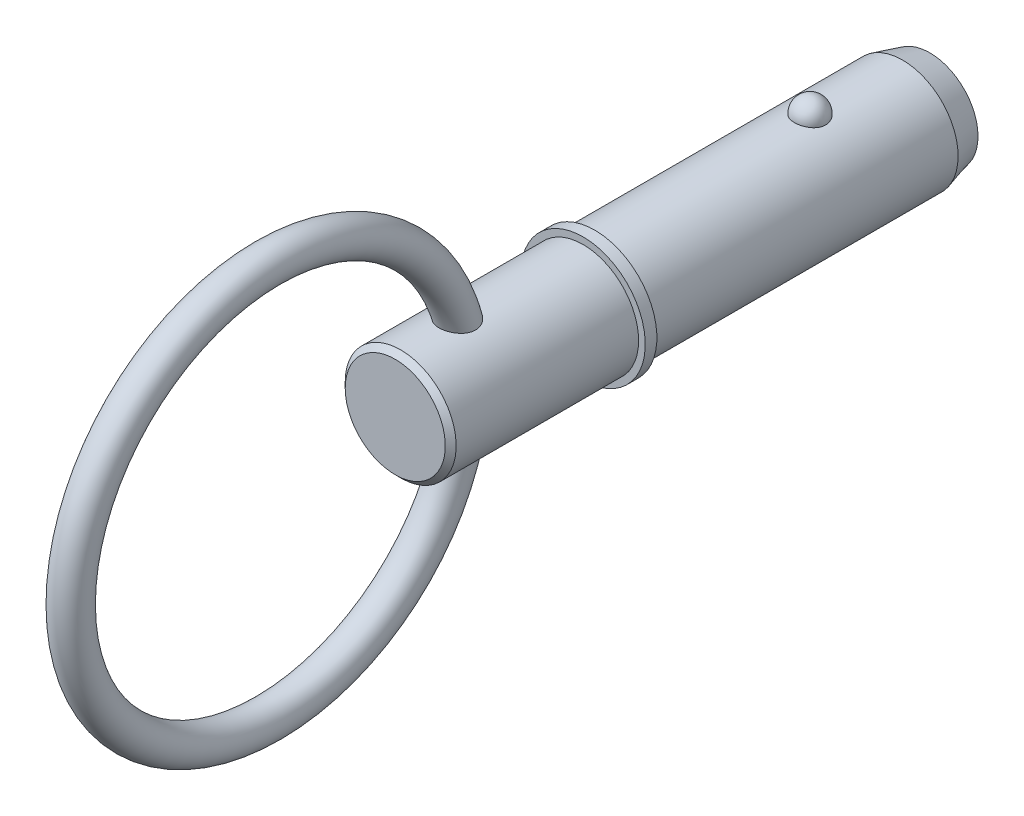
from build123d import *

# Parameters (mm, degrees)
SKETCH2_R           = 7.145
BOSS_EXTRUDE1_DEPTH = 25.7
BOSS_EXTRUDE2_START = 17.45
SKETCH3_R           = 7.145
BOSS_EXTRUDE2_DEPTH = 17.45
CHAMFER1_SIZE       = 3.5
CHAMFER1_SIZE2      = 0.937822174
SKETCH20_W          = 1.5
SKETCH20_H          = 8
SKETCH21_R          = 7.145
BOSS_EXTRUDE3_DEPTH = 25.7
CHAMFER2_SIZE       = 0.7
SKETCH24_R          = 2.25


with BuildPart() as part:
    # Sketch2 → Boss-Extrude1 (new body)
    with BuildSketch(Plane.XY):
        with Locations(Location((0, 0, 0), (0, 0, 180))):
            Circle(SKETCH2_R)
    extrude(amount=BOSS_EXTRUDE1_DEPTH)

    # Sketch3 → Boss-Extrude2 (add)
    with BuildSketch(Plane(origin=(0, 0, 0), x_dir=(-1, 0, 0), z_dir=(0, 0, -1)).offset(BOSS_EXTRUDE2_START)):
        Circle(SKETCH3_R)
    extrude(amount=-BOSS_EXTRUDE2_DEPTH)

    # Chamfer1
    chamfer1_edges = [part.edges().sort_by_distance(p)[0] for p in [
        (7.145, 0, -17.45),
    ]]
    chamfer1_side = [part.faces().sort_by_distance(p)[0] for p in [
        (7.145, 0, 4.125),
    ]]
    chamfer(chamfer1_edges, length=CHAMFER1_SIZE, length2=CHAMFER1_SIZE2, reference=chamfer1_side[0])

    # Sketch18 → Revolve1 (revolve)
    with BuildSketch(Plane(origin=(0, 0, 0), x_dir=(0, 0, -1), z_dir=(1, 0, 0))):
        with BuildLine():
            Line((2.02, 9.165), (2.02, 5.125))
            ThreePointArc((2.02, 5.125), (0, 7.145), (2.02, 9.165))
        make_face()
    revolve(axis=Axis((0, 9.165, -2.02), (0, -1, 0)))

    # Sketch20 → Revolve2 (revolve)
    with BuildSketch(Plane(origin=(0, 0, 0), x_dir=(0, 0, -1), z_dir=(1, 0, 0)), mode=Mode.PRIVATE) as revolve2_sk:
        with Locations((-26.45, 4)):
            Rectangle(SKETCH20_W, SKETCH20_H)
    revolve(revolve2_sk.sketch.rotate(Axis((0, 0, 33.728787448), (0, 0, 1)), 270), axis=Axis((0, 0, 33.728787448), (0, 0, 1)))

    # Sketch21 → Boss-Extrude3 (add)
    with BuildSketch(Plane(origin=(0, 0, 25.7), x_dir=(-1, 0, 0), z_dir=(0, 0, -1))):
        with Locations(Location((0, 0, 0), (0, 0, 180))):
            Circle(SKETCH21_R)
    extrude(amount=-BOSS_EXTRUDE3_DEPTH)

    # Chamfer2
    chamfer2_edges = [part.edges().sort_by_distance(p)[0] for p in [
        (-7.145, 0, 51.4),
    ]]
    chamfer(chamfer2_edges, length=CHAMFER2_SIZE)

    # Sweep1: sweep along a path in Sketch23
    with BuildLine(Plane(origin=(0, 0, 0), x_dir=(0, 0, -1), z_dir=(1, 0, 0))) as sweep1_path:
        CenterArc((-67.8, 0), 25.4, 0, 360)
    # Sketch24 → Sweep1 (sweep)
    with BuildSketch(Plane(origin=(0, 0, 0), x_dir=(1, 0, 0), z_dir=(0, 1, 0))):
        with Locations((0, -42.4)):
            Circle(SKETCH24_R)
    sweep(path=sweep1_path.line)


solid = part.part
